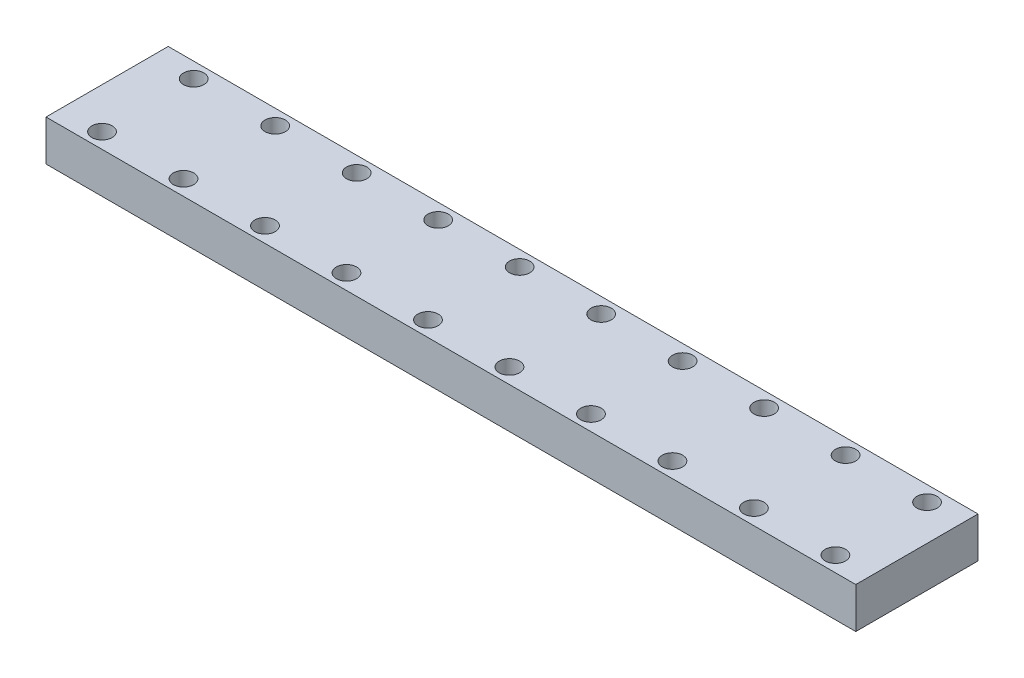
from build123d import *

# Parameters (mm, degrees)
SKETCH_1_W      = 159
SKETCH_1_H      = 24
SKETCH_1_R      = 2
EXTRUDE_1_DEPTH = 8


with BuildPart() as part:
    # Sketch 1 → Extrude 1 (new body)
    with BuildSketch(Plane(origin=(0, 0, 0), x_dir=(1, 0, 0), z_dir=(0, 1, 0))):
        with Locations((54.769565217, -0.834782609)):
            Rectangle(SKETCH_1_W, SKETCH_1_H)
        with Locations(Location((-16.730434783, 8.165217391, 0), (0, 0, 270))):
            Circle(SKETCH_1_R, mode=Mode.SUBTRACT)
        with Locations(Location((-0.730434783, 8.165217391, 0), (0, 0, 270))):
            Circle(SKETCH_1_R, mode=Mode.SUBTRACT)
        with Locations(Location((15.269565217, 8.165217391, 0), (0, 0, 270))):
            Circle(SKETCH_1_R, mode=Mode.SUBTRACT)
        with Locations(Location((31.269565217, 8.165217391, 0), (0, 0, 270))):
            Circle(SKETCH_1_R, mode=Mode.SUBTRACT)
        with Locations(Location((47.269565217, 8.165217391, 0), (0, 0, 270))):
            Circle(SKETCH_1_R, mode=Mode.SUBTRACT)
        with Locations(Location((63.269565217, 8.165217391, 0), (0, 0, 270))):
            Circle(SKETCH_1_R, mode=Mode.SUBTRACT)
        with Locations(Location((79.269565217, 8.165217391, 0), (0, 0, 270))):
            Circle(SKETCH_1_R, mode=Mode.SUBTRACT)
        with Locations(Location((95.269565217, 8.165217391, 0), (0, 0, 270))):
            Circle(SKETCH_1_R, mode=Mode.SUBTRACT)
        with Locations(Location((111.269565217, 8.165217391, 0), (0, 0, 270))):
            Circle(SKETCH_1_R, mode=Mode.SUBTRACT)
        with Locations(Location((127.269565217, 8.165217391, 0), (0, 0, 270))):
            Circle(SKETCH_1_R, mode=Mode.SUBTRACT)
        with Locations(Location((-16.730434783, -9.834782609, 0), (0, 0, 270))):
            Circle(SKETCH_1_R, mode=Mode.SUBTRACT)
        with Locations(Location((-0.730434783, -9.834782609, 0), (0, 0, 270))):
            Circle(SKETCH_1_R, mode=Mode.SUBTRACT)
        with Locations(Location((15.269565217, -9.834782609, 0), (0, 0, 270))):
            Circle(SKETCH_1_R, mode=Mode.SUBTRACT)
        with Locations(Location((31.269565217, -9.834782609, 0), (0, 0, 270))):
            Circle(SKETCH_1_R, mode=Mode.SUBTRACT)
        with Locations(Location((47.269565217, -9.834782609, 0), (0, 0, 270))):
            Circle(SKETCH_1_R, mode=Mode.SUBTRACT)
        with Locations(Location((63.269565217, -9.834782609, 0), (0, 0, 270))):
            Circle(SKETCH_1_R, mode=Mode.SUBTRACT)
        with Locations(Location((79.269565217, -9.834782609, 0), (0, 0, 270))):
            Circle(SKETCH_1_R, mode=Mode.SUBTRACT)
        with Locations(Location((95.269565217, -9.834782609, 0), (0, 0, 270))):
            Circle(SKETCH_1_R, mode=Mode.SUBTRACT)
        with Locations(Location((111.269565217, -9.834782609, 0), (0, 0, 270))):
            Circle(SKETCH_1_R, mode=Mode.SUBTRACT)
        with Locations(Location((127.269565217, -9.834782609, 0), (0, 0, 270))):
            Circle(SKETCH_1_R, mode=Mode.SUBTRACT)
    extrude(amount=EXTRUDE_1_DEPTH)


solid = part.part
